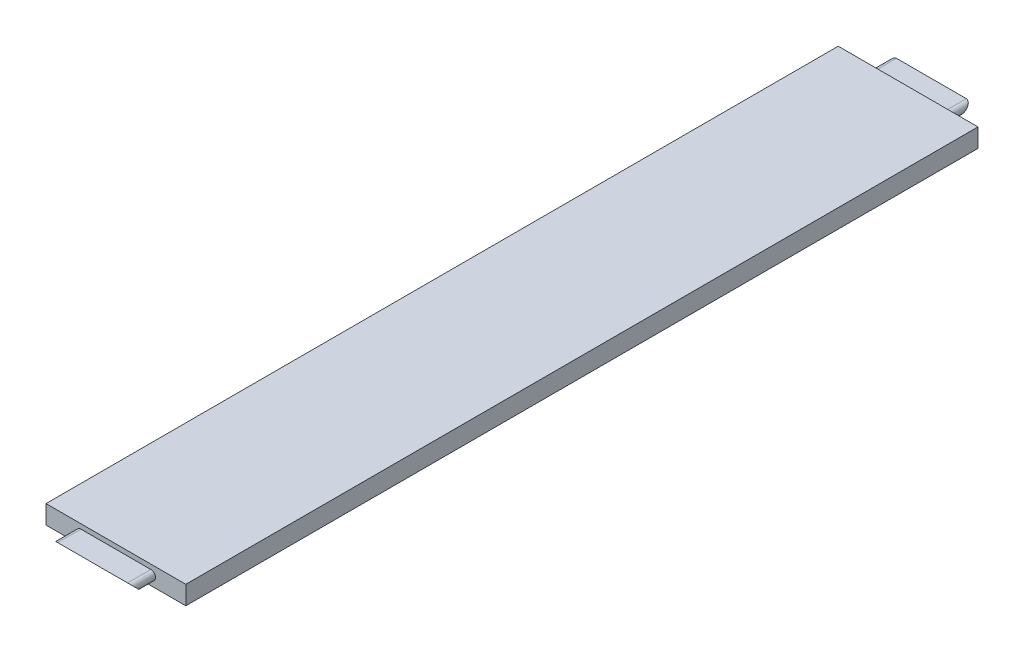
ISO-10303-21;
HEADER;
FILE_DESCRIPTION(('STEP AP214'),'2;1');
FILE_NAME('part.step','',(''),(''),'','','');
FILE_SCHEMA(('AUTOMOTIVE_DESIGN { 1 0 10303 214 1 1 1 1 }'));
ENDSEC;
DATA;
#1=APPLICATION_CONTEXT('core data for automotive mechanical design processes');
#2=APPLICATION_PROTOCOL_DEFINITION('international standard','automotive_design',2000,#1);
#3=PRODUCT_CONTEXT('',#1,'mechanical');
#4=PRODUCT('Part','Part','',(#3));
#5=PRODUCT_RELATED_PRODUCT_CATEGORY('part','',(#4));
#6=PRODUCT_DEFINITION_FORMATION('','',#4);
#7=PRODUCT_DEFINITION_CONTEXT('part definition',#1,'design');
#8=PRODUCT_DEFINITION('design','',#6,#7);
#9=PRODUCT_DEFINITION_SHAPE('','',#8);
#10=(LENGTH_UNIT() NAMED_UNIT(*) SI_UNIT(.MILLI.,.METRE.));
#11=(NAMED_UNIT(*) PLANE_ANGLE_UNIT() SI_UNIT($,.RADIAN.));
#12=(NAMED_UNIT(*) SI_UNIT($,.STERADIAN.) SOLID_ANGLE_UNIT());
#13=UNCERTAINTY_MEASURE_WITH_UNIT(LENGTH_MEASURE(1.E-05),#10,'distance_accuracy_value','');
#14=(GEOMETRIC_REPRESENTATION_CONTEXT(3) GLOBAL_UNCERTAINTY_ASSIGNED_CONTEXT((#13)) GLOBAL_UNIT_ASSIGNED_CONTEXT((#10,
#11,#12)) REPRESENTATION_CONTEXT('',''));
#15=CARTESIAN_POINT('',(0.,0.,0.));
#16=DIRECTION('',(0.,0.,1.));
#17=DIRECTION('',(1.,0.,0.));
#18=AXIS2_PLACEMENT_3D('',#15,#16,#17);
#19=CARTESIAN_POINT('',(-37.5,0.,-425.));
#20=DIRECTION('',(0.,0.,-1.));
#21=DIRECTION('',(-1.,0.,0.));
#22=AXIS2_PLACEMENT_3D('',#19,#20,#21);
#23=CYLINDRICAL_SURFACE('',#22,5.);
#24=CARTESIAN_POINT('',(-37.5,0.,-445.));
#25=DIRECTION('',(0.,-0.707106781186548,-0.707106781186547));
#26=DIRECTION('',(0.,0.707106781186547,-0.707106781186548));
#27=AXIS2_PLACEMENT_3D('',#24,#25,#26);
#28=ELLIPSE('',#27,7.07106781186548,5.);
#29=CARTESIAN_POINT('',(-37.5,-5.,-440.));
#30=VERTEX_POINT('',#29);
#31=CARTESIAN_POINT('',(-37.5,5.,-450.));
#32=VERTEX_POINT('',#31);
#33=EDGE_CURVE('E128',#30,#32,#28,.T.);
#34=ORIENTED_EDGE('',*,*,#33,.F.);
#35=DIRECTION('',(0.,0.,-1.));
#36=VECTOR('',#35,1.);
#37=CARTESIAN_POINT('',(-37.5,-5.,-425.));
#38=LINE('',#37,#36);
#39=CARTESIAN_POINT('',(-37.5,-5.,-425.));
#40=VERTEX_POINT('',#39);
#41=EDGE_CURVE('E140',#40,#30,#38,.T.);
#42=ORIENTED_EDGE('',*,*,#41,.F.);
#43=CARTESIAN_POINT('',(-37.5,0.,-425.));
#44=DIRECTION('',(0.,0.,1.));
#45=DIRECTION('',(1.,0.,0.));
#46=AXIS2_PLACEMENT_3D('',#43,#44,#45);
#47=CIRCLE('',#46,5.);
#48=CARTESIAN_POINT('',(-37.5,5.,-425.));
#49=VERTEX_POINT('',#48);
#50=EDGE_CURVE('E231',#49,#40,#47,.T.);
#51=ORIENTED_EDGE('',*,*,#50,.F.);
#52=DIRECTION('',(0.,0.,-1.));
#53=VECTOR('',#52,1.);
#54=CARTESIAN_POINT('',(-37.5,5.,-425.));
#55=LINE('',#54,#53);
#56=EDGE_CURVE('E143',#49,#32,#55,.T.);
#57=ORIENTED_EDGE('',*,*,#56,.T.);
#58=EDGE_LOOP('',(#34,#42,#51,#57));
#59=FACE_BOUND('',#58,.T.);
#60=ADVANCED_FACE('F35',(#59),#23,.T.);
#61=CARTESIAN_POINT('',(-37.5,-5.,-425.));
#62=DIRECTION('',(0.,1.,0.));
#63=DIRECTION('',(0.,0.,1.));
#64=AXIS2_PLACEMENT_3D('',#61,#62,#63);
#65=PLANE('',#64);
#66=DIRECTION('',(1.,0.,0.));
#67=VECTOR('',#66,1.);
#68=CARTESIAN_POINT('',(-75.,-5.,-440.));
#69=LINE('',#68,#67);
#70=CARTESIAN_POINT('',(37.5,-5.,-440.));
#71=VERTEX_POINT('',#70);
#72=EDGE_CURVE('E125',#30,#71,#69,.T.);
#73=ORIENTED_EDGE('',*,*,#72,.T.);
#74=DIRECTION('',(0.,0.,-1.));
#75=VECTOR('',#74,1.);
#76=CARTESIAN_POINT('',(37.5,-5.,-425.));
#77=LINE('',#76,#75);
#78=CARTESIAN_POINT('',(37.5,-5.,-425.));
#79=VERTEX_POINT('',#78);
#80=EDGE_CURVE('E149',#79,#71,#77,.T.);
#81=ORIENTED_EDGE('',*,*,#80,.F.);
#82=DIRECTION('',(1.,0.,0.));
#83=VECTOR('',#82,1.);
#84=CARTESIAN_POINT('',(-37.5,-5.,-425.));
#85=LINE('',#84,#83);
#86=EDGE_CURVE('E148',#40,#79,#85,.T.);
#87=ORIENTED_EDGE('',*,*,#86,.F.);
#88=ORIENTED_EDGE('',*,*,#41,.T.);
#89=EDGE_LOOP('',(#73,#81,#87,#88));
#90=FACE_BOUND('',#89,.T.);
#91=ADVANCED_FACE('F147',(#90),#65,.F.);
#92=CARTESIAN_POINT('',(37.5,0.,-425.));
#93=DIRECTION('',(0.,0.,-1.));
#94=DIRECTION('',(-1.,0.,0.));
#95=AXIS2_PLACEMENT_3D('',#92,#93,#94);
#96=CYLINDRICAL_SURFACE('',#95,5.);
#97=CARTESIAN_POINT('',(37.5,0.,-445.));
#98=DIRECTION('',(0.,-0.707106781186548,-0.707106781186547));
#99=DIRECTION('',(0.,0.707106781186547,-0.707106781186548));
#100=AXIS2_PLACEMENT_3D('',#97,#98,#99);
#101=ELLIPSE('',#100,7.07106781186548,5.);
#102=CARTESIAN_POINT('',(37.5,5.,-450.));
#103=VERTEX_POINT('',#102);
#104=EDGE_CURVE('E131',#103,#71,#101,.T.);
#105=ORIENTED_EDGE('',*,*,#104,.F.);
#106=DIRECTION('',(0.,0.,-1.));
#107=VECTOR('',#106,1.);
#108=CARTESIAN_POINT('',(37.5,5.,-425.));
#109=LINE('',#108,#107);
#110=CARTESIAN_POINT('',(37.5,5.,-425.));
#111=VERTEX_POINT('',#110);
#112=EDGE_CURVE('E153',#111,#103,#109,.T.);
#113=ORIENTED_EDGE('',*,*,#112,.F.);
#114=CARTESIAN_POINT('',(37.5,0.,-425.));
#115=DIRECTION('',(0.,0.,1.));
#116=DIRECTION('',(1.,0.,0.));
#117=AXIS2_PLACEMENT_3D('',#114,#115,#116);
#118=CIRCLE('',#117,5.);
#119=EDGE_CURVE('E236',#79,#111,#118,.T.);
#120=ORIENTED_EDGE('',*,*,#119,.F.);
#121=ORIENTED_EDGE('',*,*,#80,.T.);
#122=EDGE_LOOP('',(#105,#113,#120,#121));
#123=FACE_BOUND('',#122,.T.);
#124=ADVANCED_FACE('F243',(#123),#96,.T.);
#125=CARTESIAN_POINT('',(-75.,10.,-460.));
#126=DIRECTION('',(-1.,0.,0.));
#127=DIRECTION('',(0.,0.,1.));
#128=AXIS2_PLACEMENT_3D('',#125,#126,#127);
#129=PLANE('',#128);
#130=DIRECTION('',(0.,0.,1.));
#131=VECTOR('',#130,1.);
#132=CARTESIAN_POINT('',(-75.,10.,-460.));
#133=LINE('',#132,#131);
#134=CARTESIAN_POINT('',(-75.,10.,-425.));
#135=VERTEX_POINT('',#134);
#136=CARTESIAN_POINT('',(-75.,10.,425.));
#137=VERTEX_POINT('',#136);
#138=EDGE_CURVE('E11',#135,#137,#133,.T.);
#139=ORIENTED_EDGE('',*,*,#138,.F.);
#140=DIRECTION('',(0.,-1.,0.));
#141=VECTOR('',#140,1.);
#142=CARTESIAN_POINT('',(-75.,10.,-425.));
#143=LINE('',#142,#141);
#144=CARTESIAN_POINT('',(-75.,-10.,-425.));
#145=VERTEX_POINT('',#144);
#146=EDGE_CURVE('E162',#135,#145,#143,.T.);
#147=ORIENTED_EDGE('',*,*,#146,.T.);
#148=DIRECTION('',(0.,0.,1.));
#149=VECTOR('',#148,1.);
#150=CARTESIAN_POINT('',(-75.,-10.,-460.));
#151=LINE('',#150,#149);
#152=CARTESIAN_POINT('',(-75.,-10.,425.));
#153=VERTEX_POINT('',#152);
#154=EDGE_CURVE('E39',#145,#153,#151,.T.);
#155=ORIENTED_EDGE('',*,*,#154,.T.);
#156=DIRECTION('',(0.,-1.,0.));
#157=VECTOR('',#156,1.);
#158=CARTESIAN_POINT('',(-75.,10.,425.));
#159=LINE('',#158,#157);
#160=EDGE_CURVE('E205',#137,#153,#159,.T.);
#161=ORIENTED_EDGE('',*,*,#160,.F.);
#162=EDGE_LOOP('',(#139,#147,#155,#161));
#163=FACE_BOUND('',#162,.T.);
#164=ADVANCED_FACE('F37',(#163),#129,.T.);
#165=CARTESIAN_POINT('',(-75.,10.,-460.));
#166=DIRECTION('',(0.,1.,0.));
#167=DIRECTION('',(0.,0.,1.));
#168=AXIS2_PLACEMENT_3D('',#165,#166,#167);
#169=PLANE('',#168);
#170=DIRECTION('',(0.,0.,1.));
#171=VECTOR('',#170,1.);
#172=CARTESIAN_POINT('',(75.,10.,-460.));
#173=LINE('',#172,#171);
#174=CARTESIAN_POINT('',(75.,10.,-425.));
#175=VERTEX_POINT('',#174);
#176=CARTESIAN_POINT('',(75.,10.,425.));
#177=VERTEX_POINT('',#176);
#178=EDGE_CURVE('E44',#175,#177,#173,.T.);
#179=ORIENTED_EDGE('',*,*,#178,.F.);
#180=DIRECTION('',(-1.,0.,0.));
#181=VECTOR('',#180,1.);
#182=CARTESIAN_POINT('',(75.,10.,-425.));
#183=LINE('',#182,#181);
#184=EDGE_CURVE('E164',#175,#135,#183,.T.);
#185=ORIENTED_EDGE('',*,*,#184,.T.);
#186=ORIENTED_EDGE('',*,*,#138,.T.);
#187=DIRECTION('',(-1.,0.,0.));
#188=VECTOR('',#187,1.);
#189=CARTESIAN_POINT('',(75.,10.,425.));
#190=LINE('',#189,#188);
#191=EDGE_CURVE('E202',#177,#137,#190,.T.);
#192=ORIENTED_EDGE('',*,*,#191,.F.);
#193=EDGE_LOOP('',(#179,#185,#186,#192));
#194=FACE_BOUND('',#193,.T.);
#195=ADVANCED_FACE('F223',(#194),#169,.T.);
#196=CARTESIAN_POINT('',(75.,10.,-460.));
#197=DIRECTION('',(1.,0.,0.));
#198=DIRECTION('',(0.,0.,-1.));
#199=AXIS2_PLACEMENT_3D('',#196,#197,#198);
#200=PLANE('',#199);
#201=DIRECTION('',(0.,0.,1.));
#202=VECTOR('',#201,1.);
#203=CARTESIAN_POINT('',(75.,-9.99999999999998,-460.));
#204=LINE('',#203,#202);
#205=CARTESIAN_POINT('',(75.,-9.99999999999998,-425.));
#206=VERTEX_POINT('',#205);
#207=CARTESIAN_POINT('',(75.,-10.,425.));
#208=VERTEX_POINT('',#207);
#209=EDGE_CURVE('E210',#206,#208,#204,.T.);
#210=ORIENTED_EDGE('',*,*,#209,.F.);
#211=DIRECTION('',(0.,1.,0.));
#212=VECTOR('',#211,1.);
#213=CARTESIAN_POINT('',(75.,-10.,-425.));
#214=LINE('',#213,#212);
#215=EDGE_CURVE('E52',#206,#175,#214,.T.);
#216=ORIENTED_EDGE('',*,*,#215,.T.);
#217=ORIENTED_EDGE('',*,*,#178,.T.);
#218=DIRECTION('',(0.,1.,0.));
#219=VECTOR('',#218,1.);
#220=CARTESIAN_POINT('',(75.,-10.,425.));
#221=LINE('',#220,#219);
#222=EDGE_CURVE('E191',#208,#177,#221,.T.);
#223=ORIENTED_EDGE('',*,*,#222,.F.);
#224=EDGE_LOOP('',(#210,#216,#217,#223));
#225=FACE_BOUND('',#224,.T.);
#226=ADVANCED_FACE('F220',(#225),#200,.T.);
#227=CARTESIAN_POINT('',(75.,-9.99999999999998,-460.));
#228=DIRECTION('',(0.,-1.,0.));
#229=DIRECTION('',(1.,0.,0.));
#230=AXIS2_PLACEMENT_3D('',#227,#228,#229);
#231=PLANE('',#230);
#232=ORIENTED_EDGE('',*,*,#154,.F.);
#233=DIRECTION('',(1.,0.,0.));
#234=VECTOR('',#233,1.);
#235=CARTESIAN_POINT('',(-75.,-10.,-425.));
#236=LINE('',#235,#234);
#237=EDGE_CURVE('E151',#145,#206,#236,.T.);
#238=ORIENTED_EDGE('',*,*,#237,.T.);
#239=ORIENTED_EDGE('',*,*,#209,.T.);
#240=DIRECTION('',(1.,0.,0.));
#241=VECTOR('',#240,1.);
#242=CARTESIAN_POINT('',(-75.,-10.,425.));
#243=LINE('',#242,#241);
#244=EDGE_CURVE('E207',#153,#208,#243,.T.);
#245=ORIENTED_EDGE('',*,*,#244,.F.);
#246=EDGE_LOOP('',(#232,#238,#239,#245));
#247=FACE_BOUND('',#246,.T.);
#248=ADVANCED_FACE('F214',(#247),#231,.T.);
#249=CARTESIAN_POINT('',(0.,0.,425.));
#250=DIRECTION('',(0.,0.,1.));
#251=DIRECTION('',(1.,0.,0.));
#252=AXIS2_PLACEMENT_3D('',#249,#250,#251);
#253=PLANE('',#252);
#254=DIRECTION('',(-1.,0.,0.));
#255=VECTOR('',#254,1.);
#256=CARTESIAN_POINT('',(-37.5,5.,425.));
#257=LINE('',#256,#255);
#258=CARTESIAN_POINT('',(37.5,5.,425.));
#259=VERTEX_POINT('',#258);
#260=CARTESIAN_POINT('',(-37.5,5.,425.));
#261=VERTEX_POINT('',#260);
#262=EDGE_CURVE('E183',#259,#261,#257,.T.);
#263=ORIENTED_EDGE('',*,*,#262,.F.);
#264=CARTESIAN_POINT('',(37.5,0.,425.));
#265=DIRECTION('',(0.,0.,1.));
#266=DIRECTION('',(1.,0.,0.));
#267=AXIS2_PLACEMENT_3D('',#264,#265,#266);
#268=CIRCLE('',#267,5.);
#269=CARTESIAN_POINT('',(37.5,-5.,425.));
#270=VERTEX_POINT('',#269);
#271=EDGE_CURVE('E180',#270,#259,#268,.T.);
#272=ORIENTED_EDGE('',*,*,#271,.F.);
#273=DIRECTION('',(1.,0.,0.));
#274=VECTOR('',#273,1.);
#275=CARTESIAN_POINT('',(-37.5,-5.,425.));
#276=LINE('',#275,#274);
#277=CARTESIAN_POINT('',(-37.5,-5.,425.));
#278=VERTEX_POINT('',#277);
#279=EDGE_CURVE('E177',#278,#270,#276,.T.);
#280=ORIENTED_EDGE('',*,*,#279,.F.);
#281=CARTESIAN_POINT('',(-37.5,0.,425.));
#282=DIRECTION('',(0.,0.,1.));
#283=DIRECTION('',(1.,0.,0.));
#284=AXIS2_PLACEMENT_3D('',#281,#282,#283);
#285=CIRCLE('',#284,5.);
#286=EDGE_CURVE('E174',#261,#278,#285,.T.);
#287=ORIENTED_EDGE('',*,*,#286,.F.);
#288=EDGE_LOOP('',(#263,#272,#280,#287));
#289=FACE_BOUND('',#288,.T.);
#290=ORIENTED_EDGE('',*,*,#222,.T.);
#291=ORIENTED_EDGE('',*,*,#191,.T.);
#292=ORIENTED_EDGE('',*,*,#160,.T.);
#293=ORIENTED_EDGE('',*,*,#244,.T.);
#294=EDGE_LOOP('',(#290,#291,#292,#293));
#295=FACE_BOUND('',#294,.T.);
#296=ADVANCED_FACE('F218',(#289,#295),#253,.T.);
#297=CARTESIAN_POINT('',(-37.5,0.,425.));
#298=DIRECTION('',(0.,0.,1.));
#299=DIRECTION('',(1.,0.,0.));
#300=AXIS2_PLACEMENT_3D('',#297,#298,#299);
#301=CYLINDRICAL_SURFACE('',#300,5.);
#302=CARTESIAN_POINT('',(-37.5,0.,445.));
#303=DIRECTION('',(0.,0.707106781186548,-0.707106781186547));
#304=DIRECTION('',(0.,0.707106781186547,0.707106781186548));
#305=AXIS2_PLACEMENT_3D('',#302,#303,#304);
#306=ELLIPSE('',#305,7.07106781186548,5.);
#307=CARTESIAN_POINT('',(-37.5,5.,450.));
#308=VERTEX_POINT('',#307);
#309=CARTESIAN_POINT('',(-37.5,-5.,440.));
#310=VERTEX_POINT('',#309);
#311=EDGE_CURVE('E171',#308,#310,#306,.F.);
#312=ORIENTED_EDGE('',*,*,#311,.F.);
#313=DIRECTION('',(0.,0.,1.));
#314=VECTOR('',#313,1.);
#315=CARTESIAN_POINT('',(-37.5,5.,425.));
#316=LINE('',#315,#314);
#317=EDGE_CURVE('E188',#261,#308,#316,.T.);
#318=ORIENTED_EDGE('',*,*,#317,.F.);
#319=ORIENTED_EDGE('',*,*,#286,.T.);
#320=DIRECTION('',(0.,0.,1.));
#321=VECTOR('',#320,1.);
#322=CARTESIAN_POINT('',(-37.5,-5.,425.));
#323=LINE('',#322,#321);
#324=EDGE_CURVE('E186',#278,#310,#323,.T.);
#325=ORIENTED_EDGE('',*,*,#324,.T.);
#326=EDGE_LOOP('',(#312,#318,#319,#325));
#327=FACE_BOUND('',#326,.T.);
#328=ADVANCED_FACE('F265',(#327),#301,.T.);
#329=CARTESIAN_POINT('',(-37.5,5.,425.));
#330=DIRECTION('',(0.,1.,0.));
#331=DIRECTION('',(0.,0.,1.));
#332=AXIS2_PLACEMENT_3D('',#329,#330,#331);
#333=PLANE('',#332);
#334=DIRECTION('',(-1.,0.,0.));
#335=VECTOR('',#334,1.);
#336=CARTESIAN_POINT('',(-37.5,5.,450.));
#337=LINE('',#336,#335);
#338=CARTESIAN_POINT('',(37.5,5.,450.));
#339=VERTEX_POINT('',#338);
#340=EDGE_CURVE('E173',#339,#308,#337,.T.);
#341=ORIENTED_EDGE('',*,*,#340,.F.);
#342=DIRECTION('',(0.,0.,1.));
#343=VECTOR('',#342,1.);
#344=CARTESIAN_POINT('',(37.5,5.,425.));
#345=LINE('',#344,#343);
#346=EDGE_CURVE('E192',#259,#339,#345,.T.);
#347=ORIENTED_EDGE('',*,*,#346,.F.);
#348=ORIENTED_EDGE('',*,*,#262,.T.);
#349=ORIENTED_EDGE('',*,*,#317,.T.);
#350=EDGE_LOOP('',(#341,#347,#348,#349));
#351=FACE_BOUND('',#350,.T.);
#352=ADVANCED_FACE('F261',(#351),#333,.T.);
#353=CARTESIAN_POINT('',(37.5,0.,425.));
#354=DIRECTION('',(0.,0.,1.));
#355=DIRECTION('',(1.,0.,0.));
#356=AXIS2_PLACEMENT_3D('',#353,#354,#355);
#357=CYLINDRICAL_SURFACE('',#356,5.);
#358=CARTESIAN_POINT('',(37.5,0.,445.));
#359=DIRECTION('',(0.,0.707106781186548,-0.707106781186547));
#360=DIRECTION('',(0.,0.707106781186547,0.707106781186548));
#361=AXIS2_PLACEMENT_3D('',#358,#359,#360);
#362=ELLIPSE('',#361,7.07106781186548,5.);
#363=CARTESIAN_POINT('',(37.5,-5.,440.));
#364=VERTEX_POINT('',#363);
#365=EDGE_CURVE('E169',#364,#339,#362,.F.);
#366=ORIENTED_EDGE('',*,*,#365,.F.);
#367=DIRECTION('',(0.,0.,1.));
#368=VECTOR('',#367,1.);
#369=CARTESIAN_POINT('',(37.5,-5.,425.));
#370=LINE('',#369,#368);
#371=EDGE_CURVE('E195',#270,#364,#370,.T.);
#372=ORIENTED_EDGE('',*,*,#371,.F.);
#373=ORIENTED_EDGE('',*,*,#271,.T.);
#374=ORIENTED_EDGE('',*,*,#346,.T.);
#375=EDGE_LOOP('',(#366,#372,#373,#374));
#376=FACE_BOUND('',#375,.T.);
#377=ADVANCED_FACE('F264',(#376),#357,.T.);
#378=CARTESIAN_POINT('',(-37.5,-5.,425.));
#379=DIRECTION('',(0.,-1.,0.));
#380=DIRECTION('',(0.,0.,-1.));
#381=AXIS2_PLACEMENT_3D('',#378,#379,#380);
#382=PLANE('',#381);
#383=DIRECTION('',(1.,0.,0.));
#384=VECTOR('',#383,1.);
#385=CARTESIAN_POINT('',(-75.,-5.,440.));
#386=LINE('',#385,#384);
#387=EDGE_CURVE('E167',#310,#364,#386,.T.);
#388=ORIENTED_EDGE('',*,*,#387,.F.);
#389=ORIENTED_EDGE('',*,*,#324,.F.);
#390=ORIENTED_EDGE('',*,*,#279,.T.);
#391=ORIENTED_EDGE('',*,*,#371,.T.);
#392=EDGE_LOOP('',(#388,#389,#390,#391));
#393=FACE_BOUND('',#392,.T.);
#394=ADVANCED_FACE('F259',(#393),#382,.T.);
#395=CARTESIAN_POINT('',(-75.,5.,450.));
#396=DIRECTION('',(0.,0.707106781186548,-0.707106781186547));
#397=DIRECTION('',(0.,0.707106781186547,0.707106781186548));
#398=AXIS2_PLACEMENT_3D('',#395,#396,#397);
#399=PLANE('',#398);
#400=ORIENTED_EDGE('',*,*,#311,.T.);
#401=ORIENTED_EDGE('',*,*,#387,.T.);
#402=ORIENTED_EDGE('',*,*,#365,.T.);
#403=ORIENTED_EDGE('',*,*,#340,.T.);
#404=EDGE_LOOP('',(#400,#401,#402,#403));
#405=FACE_BOUND('',#404,.T.);
#406=ADVANCED_FACE('F229',(#405),#399,.F.);
#407=CARTESIAN_POINT('',(0.,0.,-425.));
#408=DIRECTION('',(0.,0.,-1.));
#409=DIRECTION('',(1.,0.,0.));
#410=AXIS2_PLACEMENT_3D('',#407,#408,#409);
#411=PLANE('',#410);
#412=ORIENTED_EDGE('',*,*,#215,.F.);
#413=ORIENTED_EDGE('',*,*,#237,.F.);
#414=ORIENTED_EDGE('',*,*,#146,.F.);
#415=ORIENTED_EDGE('',*,*,#184,.F.);
#416=EDGE_LOOP('',(#412,#413,#414,#415));
#417=FACE_BOUND('',#416,.T.);
#418=ORIENTED_EDGE('',*,*,#50,.T.);
#419=ORIENTED_EDGE('',*,*,#86,.T.);
#420=ORIENTED_EDGE('',*,*,#119,.T.);
#421=DIRECTION('',(-1.,0.,0.));
#422=VECTOR('',#421,1.);
#423=CARTESIAN_POINT('',(-37.5,5.,-425.));
#424=LINE('',#423,#422);
#425=EDGE_CURVE('E234',#111,#49,#424,.T.);
#426=ORIENTED_EDGE('',*,*,#425,.T.);
#427=EDGE_LOOP('',(#418,#419,#420,#426));
#428=FACE_BOUND('',#427,.T.);
#429=ADVANCED_FACE('F225',(#417,#428),#411,.T.);
#430=CARTESIAN_POINT('',(-37.5,5.,-425.));
#431=DIRECTION('',(0.,-1.,0.));
#432=DIRECTION('',(0.,0.,-1.));
#433=AXIS2_PLACEMENT_3D('',#430,#431,#432);
#434=PLANE('',#433);
#435=DIRECTION('',(-1.,0.,0.));
#436=VECTOR('',#435,1.);
#437=CARTESIAN_POINT('',(-37.5,5.,-450.));
#438=LINE('',#437,#436);
#439=EDGE_CURVE('E145',#103,#32,#438,.T.);
#440=ORIENTED_EDGE('',*,*,#439,.T.);
#441=ORIENTED_EDGE('',*,*,#56,.F.);
#442=ORIENTED_EDGE('',*,*,#425,.F.);
#443=ORIENTED_EDGE('',*,*,#112,.T.);
#444=EDGE_LOOP('',(#440,#441,#442,#443));
#445=FACE_BOUND('',#444,.T.);
#446=ADVANCED_FACE('F228',(#445),#434,.F.);
#447=CARTESIAN_POINT('',(-75.,5.,-450.));
#448=DIRECTION('',(0.,-0.707106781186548,-0.707106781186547));
#449=DIRECTION('',(0.,0.707106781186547,-0.707106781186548));
#450=AXIS2_PLACEMENT_3D('',#447,#448,#449);
#451=PLANE('',#450);
#452=ORIENTED_EDGE('',*,*,#33,.T.);
#453=ORIENTED_EDGE('',*,*,#439,.F.);
#454=ORIENTED_EDGE('',*,*,#104,.T.);
#455=ORIENTED_EDGE('',*,*,#72,.F.);
#456=EDGE_LOOP('',(#452,#453,#454,#455));
#457=FACE_BOUND('',#456,.T.);
#458=ADVANCED_FACE('F127',(#457),#451,.T.);
#459=CLOSED_SHELL('',(#60,#91,#124,#164,#195,#226,#248,#296,#328,#352,#377,#394,#406,#429,#446,#458));
#460=MANIFOLD_SOLID_BREP('B2',#459);
#461=ADVANCED_BREP_SHAPE_REPRESENTATION('',(#18,#460),#14);
#462=SHAPE_DEFINITION_REPRESENTATION(#9,#461);
ENDSEC;
END-ISO-10303-21;
